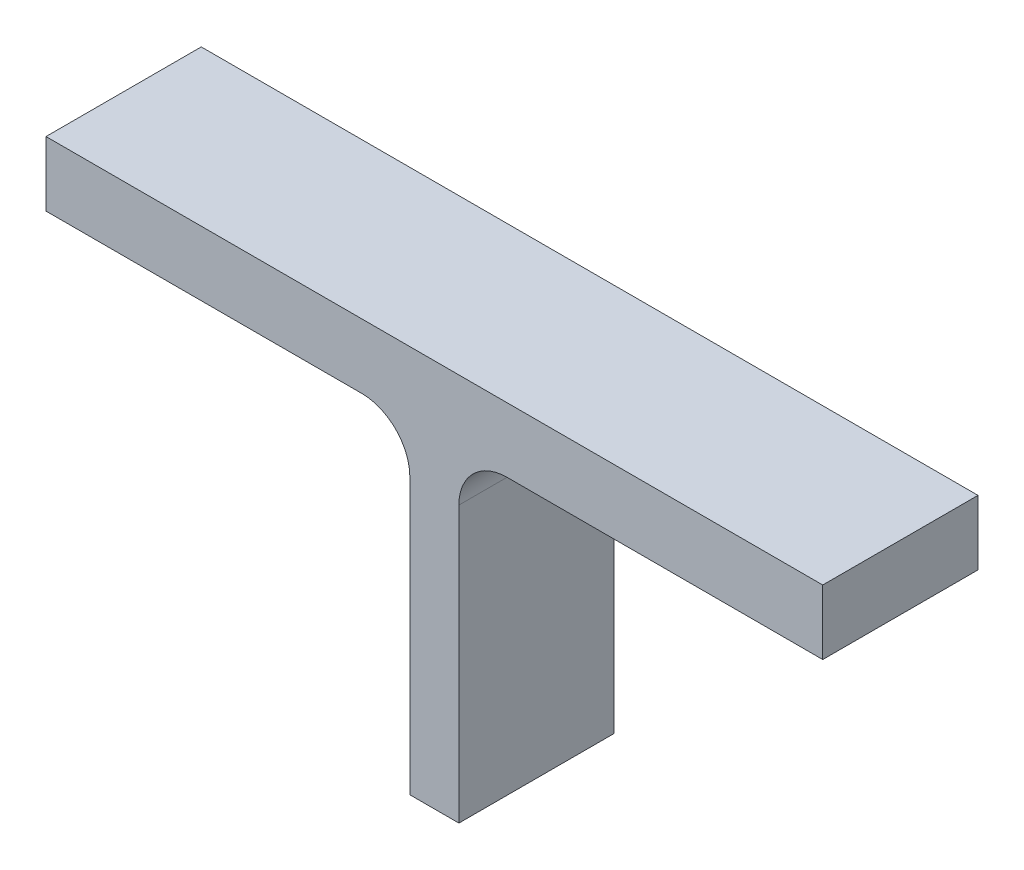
from build123d import *

# Parameters (mm, degrees)
BASESTEELMT_DEPTH = 12.7


with BuildPart() as part:
    # Sketch1 → BaseSteelMT (new, symmetric)
    with BuildSketch(Plane.XY):
        with BuildLine():
            Line((-4.0132, 0), (4.0132, 0))
            Line((4.0132, 0), (4.0132, 45.0596))
            ThreePointArc((4.0132, 45.0596), (6.319441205, 50.627358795), (11.8872, 52.9336))
            Line((11.8872, 52.9336), (63.5381, 52.9336))
            Line((63.5381, 52.9336), (63.5381, 63.5))
            Line((63.5381, 63.5), (-63.5381, 63.5))
            Line((-63.5381, 63.5), (-63.5381, 52.9336))
            Line((-63.5381, 52.9336), (-11.8872, 52.9336))
            ThreePointArc((-11.8872, 52.9336), (-6.319441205, 50.627358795), (-4.0132, 45.0596))
            Line((-4.0132, 45.0596), (-4.0132, 0))
        make_face()
    extrude(amount=BASESTEELMT_DEPTH, both=True)


solid = part.part
